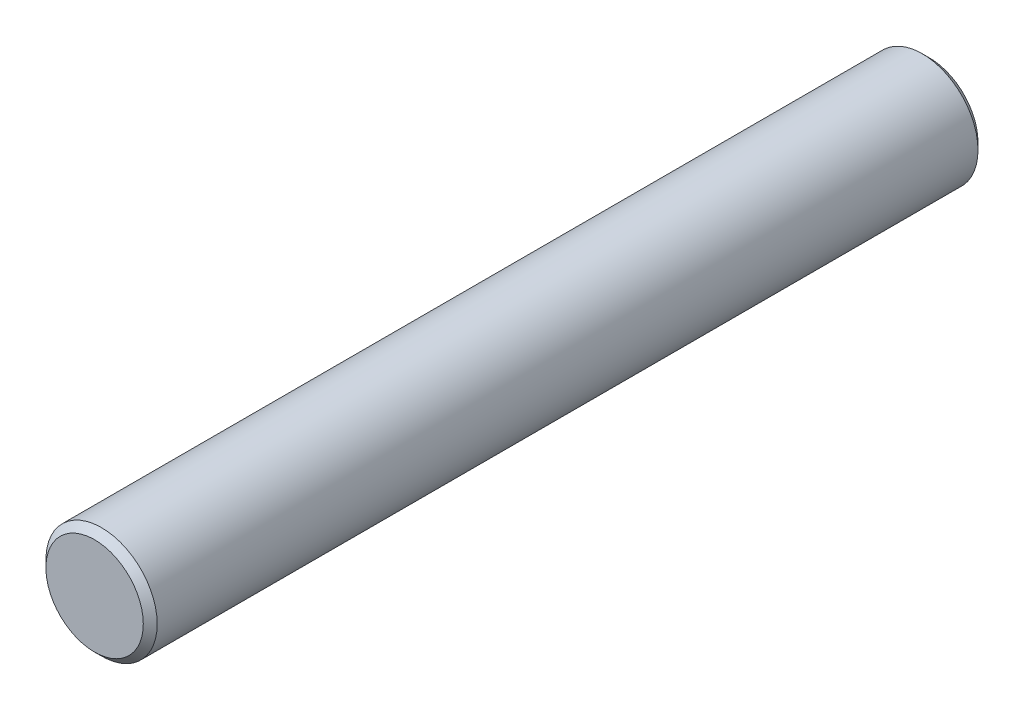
ISO-10303-21;
HEADER;
FILE_DESCRIPTION(('STEP AP214'),'2;1');
FILE_NAME('part.step','',(''),(''),'','','');
FILE_SCHEMA(('AUTOMOTIVE_DESIGN { 1 0 10303 214 1 1 1 1 }'));
ENDSEC;
DATA;
#1=APPLICATION_CONTEXT('core data for automotive mechanical design processes');
#2=APPLICATION_PROTOCOL_DEFINITION('international standard','automotive_design',2000,#1);
#3=PRODUCT_CONTEXT('',#1,'mechanical');
#4=PRODUCT('Part','Part','',(#3));
#5=PRODUCT_RELATED_PRODUCT_CATEGORY('part','',(#4));
#6=PRODUCT_DEFINITION_FORMATION('','',#4);
#7=PRODUCT_DEFINITION_CONTEXT('part definition',#1,'design');
#8=PRODUCT_DEFINITION('design','',#6,#7);
#9=PRODUCT_DEFINITION_SHAPE('','',#8);
#10=(LENGTH_UNIT() NAMED_UNIT(*) SI_UNIT(.MILLI.,.METRE.));
#11=(NAMED_UNIT(*) PLANE_ANGLE_UNIT() SI_UNIT($,.RADIAN.));
#12=(NAMED_UNIT(*) SI_UNIT($,.STERADIAN.) SOLID_ANGLE_UNIT());
#13=UNCERTAINTY_MEASURE_WITH_UNIT(LENGTH_MEASURE(1.E-05),#10,'distance_accuracy_value','');
#14=(GEOMETRIC_REPRESENTATION_CONTEXT(3) GLOBAL_UNCERTAINTY_ASSIGNED_CONTEXT((#13)) GLOBAL_UNIT_ASSIGNED_CONTEXT((#10,
#11,#12)) REPRESENTATION_CONTEXT('',''));
#15=CARTESIAN_POINT('',(0.,0.,0.));
#16=DIRECTION('',(0.,0.,1.));
#17=DIRECTION('',(1.,0.,0.));
#18=AXIS2_PLACEMENT_3D('',#15,#16,#17);
#19=CARTESIAN_POINT('',(0.,0.,60.));
#20=DIRECTION('',(0.,0.,-1.));
#21=DIRECTION('',(-1.,0.,0.));
#22=AXIS2_PLACEMENT_3D('',#19,#20,#21);
#23=CYLINDRICAL_SURFACE('',#22,4.);
#24=CARTESIAN_POINT('',(0.,0.,0.5));
#25=DIRECTION('',(0.,0.,1.));
#26=DIRECTION('',(1.,0.,0.));
#27=AXIS2_PLACEMENT_3D('',#24,#25,#26);
#28=CIRCLE('',#27,4.);
#29=CARTESIAN_POINT('',(4.,0.,0.5));
#30=VERTEX_POINT('',#29);
#31=EDGE_CURVE('E41',#30,#30,#28,.T.);
#32=ORIENTED_EDGE('',*,*,#31,.T.);
#33=EDGE_LOOP('',(#32));
#34=FACE_BOUND('',#33,.T.);
#35=CARTESIAN_POINT('',(0.,0.,59.5));
#36=DIRECTION('',(0.,0.,1.));
#37=DIRECTION('',(1.,0.,0.));
#38=AXIS2_PLACEMENT_3D('',#35,#36,#37);
#39=CIRCLE('',#38,4.);
#40=CARTESIAN_POINT('',(4.,0.,59.5));
#41=VERTEX_POINT('',#40);
#42=EDGE_CURVE('E45',#41,#41,#39,.F.);
#43=ORIENTED_EDGE('',*,*,#42,.T.);
#44=EDGE_LOOP('',(#43));
#45=FACE_BOUND('',#44,.T.);
#46=ADVANCED_FACE('F31',(#34,#45),#23,.T.);
#47=CARTESIAN_POINT('',(0.,0.,60.));
#48=DIRECTION('',(0.,0.,1.));
#49=DIRECTION('',(1.,0.,0.));
#50=AXIS2_PLACEMENT_3D('',#47,#48,#49);
#51=PLANE('',#50);
#52=CARTESIAN_POINT('',(0.,0.,60.));
#53=DIRECTION('',(0.,0.,1.));
#54=DIRECTION('',(1.,0.,0.));
#55=AXIS2_PLACEMENT_3D('',#52,#53,#54);
#56=CIRCLE('',#55,3.49999999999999);
#57=CARTESIAN_POINT('',(3.49999999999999,0.,60.));
#58=VERTEX_POINT('',#57);
#59=EDGE_CURVE('E10',#58,#58,#56,.T.);
#60=ORIENTED_EDGE('',*,*,#59,.T.);
#61=EDGE_LOOP('',(#60));
#62=FACE_BOUND('',#61,.T.);
#63=ADVANCED_FACE('F64',(#62),#51,.T.);
#64=CARTESIAN_POINT('',(0.,0.,0.));
#65=DIRECTION('',(0.,0.,1.));
#66=DIRECTION('',(1.,0.,0.));
#67=AXIS2_PLACEMENT_3D('',#64,#65,#66);
#68=PLANE('',#67);
#69=CARTESIAN_POINT('',(0.,0.,0.));
#70=DIRECTION('',(0.,0.,1.));
#71=DIRECTION('',(1.,0.,0.));
#72=AXIS2_PLACEMENT_3D('',#69,#70,#71);
#73=CIRCLE('',#72,3.49999999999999);
#74=CARTESIAN_POINT('',(3.49999999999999,0.,0.));
#75=VERTEX_POINT('',#74);
#76=EDGE_CURVE('E37',#75,#75,#73,.F.);
#77=ORIENTED_EDGE('',*,*,#76,.T.);
#78=EDGE_LOOP('',(#77));
#79=FACE_BOUND('',#78,.T.);
#80=ADVANCED_FACE('F60',(#79),#68,.F.);
#81=CARTESIAN_POINT('',(0.,0.,0.5));
#82=DIRECTION('',(0.,0.,1.));
#83=DIRECTION('',(1.,0.,0.));
#84=AXIS2_PLACEMENT_3D('',#81,#82,#83);
#85=CONICAL_SURFACE('',#84,4.,0.785398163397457);
#86=ORIENTED_EDGE('',*,*,#76,.F.);
#87=EDGE_LOOP('',(#86));
#88=FACE_BOUND('',#87,.T.);
#89=ORIENTED_EDGE('',*,*,#31,.F.);
#90=EDGE_LOOP('',(#89));
#91=FACE_BOUND('',#90,.T.);
#92=ADVANCED_FACE('F55',(#88,#91),#85,.T.);
#93=CARTESIAN_POINT('',(0.,0.,60.));
#94=DIRECTION('',(0.,0.,-1.));
#95=DIRECTION('',(-1.,0.,0.));
#96=AXIS2_PLACEMENT_3D('',#93,#94,#95);
#97=CONICAL_SURFACE('',#96,3.49999999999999,0.785398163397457);
#98=ORIENTED_EDGE('',*,*,#42,.F.);
#99=EDGE_LOOP('',(#98));
#100=FACE_BOUND('',#99,.T.);
#101=ORIENTED_EDGE('',*,*,#59,.F.);
#102=EDGE_LOOP('',(#101));
#103=FACE_BOUND('',#102,.T.);
#104=ADVANCED_FACE('F52',(#100,#103),#97,.T.);
#105=CLOSED_SHELL('',(#46,#63,#80,#92,#104));
#106=MANIFOLD_SOLID_BREP('B2',#105);
#107=ADVANCED_BREP_SHAPE_REPRESENTATION('',(#18,#106),#14);
#108=SHAPE_DEFINITION_REPRESENTATION(#9,#107);
ENDSEC;
END-ISO-10303-21;
